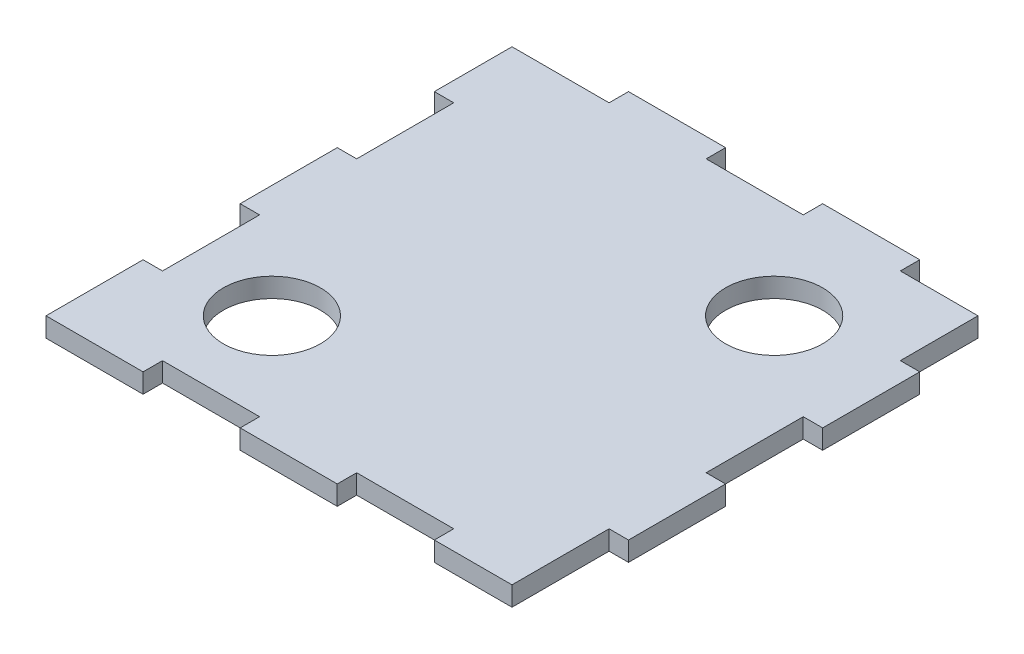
ISO-10303-21;
HEADER;
FILE_DESCRIPTION(('STEP AP214'),'2;1');
FILE_NAME('part.step','',(''),(''),'','','');
FILE_SCHEMA(('AUTOMOTIVE_DESIGN { 1 0 10303 214 1 1 1 1 }'));
ENDSEC;
DATA;
#1=APPLICATION_CONTEXT('core data for automotive mechanical design processes');
#2=APPLICATION_PROTOCOL_DEFINITION('international standard','automotive_design',2000,#1);
#3=PRODUCT_CONTEXT('',#1,'mechanical');
#4=PRODUCT('Part','Part','',(#3));
#5=PRODUCT_RELATED_PRODUCT_CATEGORY('part','',(#4));
#6=PRODUCT_DEFINITION_FORMATION('','',#4);
#7=PRODUCT_DEFINITION_CONTEXT('part definition',#1,'design');
#8=PRODUCT_DEFINITION('design','',#6,#7);
#9=PRODUCT_DEFINITION_SHAPE('','',#8);
#10=(LENGTH_UNIT() NAMED_UNIT(*) SI_UNIT(.MILLI.,.METRE.));
#11=(NAMED_UNIT(*) PLANE_ANGLE_UNIT() SI_UNIT($,.RADIAN.));
#12=(NAMED_UNIT(*) SI_UNIT($,.STERADIAN.) SOLID_ANGLE_UNIT());
#13=UNCERTAINTY_MEASURE_WITH_UNIT(LENGTH_MEASURE(1.E-05),#10,'distance_accuracy_value','');
#14=(GEOMETRIC_REPRESENTATION_CONTEXT(3) GLOBAL_UNCERTAINTY_ASSIGNED_CONTEXT((#13)) GLOBAL_UNIT_ASSIGNED_CONTEXT((#10,
#11,#12)) REPRESENTATION_CONTEXT('',''));
#15=CARTESIAN_POINT('',(0.,0.,0.));
#16=DIRECTION('',(0.,0.,1.));
#17=DIRECTION('',(1.,0.,0.));
#18=AXIS2_PLACEMENT_3D('',#15,#16,#17);
#19=CARTESIAN_POINT('',(0.,4.,0.));
#20=DIRECTION('',(0.,1.,0.));
#21=DIRECTION('',(0.,0.,1.));
#22=AXIS2_PLACEMENT_3D('',#19,#20,#21);
#23=PLANE('',#22);
#24=CARTESIAN_POINT('',(25.,4.,-25.));
#25=DIRECTION('',(0.,1.,0.));
#26=DIRECTION('',(0.,0.,1.));
#27=AXIS2_PLACEMENT_3D('',#24,#25,#26);
#28=CIRCLE('',#27,10.);
#29=CARTESIAN_POINT('',(25.,4.,-15.));
#30=VERTEX_POINT('',#29);
#31=EDGE_CURVE('E302',#30,#30,#28,.T.);
#32=ORIENTED_EDGE('',*,*,#31,.F.);
#33=EDGE_LOOP('',(#32));
#34=FACE_BOUND('',#33,.T.);
#35=DIRECTION('',(0.,0.,-1.));
#36=VECTOR('',#35,1.);
#37=CARTESIAN_POINT('',(46.,4.,30.));
#38=LINE('',#37,#36);
#39=CARTESIAN_POINT('',(46.,4.,50.));
#40=VERTEX_POINT('',#39);
#41=CARTESIAN_POINT('',(46.,4.,30.));
#42=VERTEX_POINT('',#41);
#43=EDGE_CURVE('E369',#40,#42,#38,.T.);
#44=ORIENTED_EDGE('',*,*,#43,.T.);
#45=DIRECTION('',(1.,0.,0.));
#46=VECTOR('',#45,1.);
#47=CARTESIAN_POINT('',(50.,4.,30.));
#48=LINE('',#47,#46);
#49=CARTESIAN_POINT('',(50.,4.,30.));
#50=VERTEX_POINT('',#49);
#51=EDGE_CURVE('E177',#42,#50,#48,.T.);
#52=ORIENTED_EDGE('',*,*,#51,.T.);
#53=DIRECTION('',(0.,0.,-1.));
#54=VECTOR('',#53,1.);
#55=CARTESIAN_POINT('',(50.,4.,9.99999999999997));
#56=LINE('',#55,#54);
#57=CARTESIAN_POINT('',(50.,4.,9.99999999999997));
#58=VERTEX_POINT('',#57);
#59=EDGE_CURVE('E468',#50,#58,#56,.T.);
#60=ORIENTED_EDGE('',*,*,#59,.T.);
#61=DIRECTION('',(-1.,0.,0.));
#62=VECTOR('',#61,1.);
#63=CARTESIAN_POINT('',(46.,4.,9.99999999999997));
#64=LINE('',#63,#62);
#65=CARTESIAN_POINT('',(46.,4.,9.99999999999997));
#66=VERTEX_POINT('',#65);
#67=EDGE_CURVE('E487',#58,#66,#64,.T.);
#68=ORIENTED_EDGE('',*,*,#67,.T.);
#69=DIRECTION('',(0.,0.,-1.));
#70=VECTOR('',#69,1.);
#71=CARTESIAN_POINT('',(46.,4.,-10.));
#72=LINE('',#71,#70);
#73=CARTESIAN_POINT('',(46.,4.,-10.));
#74=VERTEX_POINT('',#73);
#75=EDGE_CURVE('E484',#66,#74,#72,.T.);
#76=ORIENTED_EDGE('',*,*,#75,.T.);
#77=DIRECTION('',(1.,0.,0.));
#78=VECTOR('',#77,1.);
#79=CARTESIAN_POINT('',(50.,4.,-10.));
#80=LINE('',#79,#78);
#81=CARTESIAN_POINT('',(50.,4.,-10.));
#82=VERTEX_POINT('',#81);
#83=EDGE_CURVE('E486',#74,#82,#80,.T.);
#84=ORIENTED_EDGE('',*,*,#83,.T.);
#85=DIRECTION('',(0.,0.,-1.));
#86=VECTOR('',#85,1.);
#87=CARTESIAN_POINT('',(50.,4.,-30.));
#88=LINE('',#87,#86);
#89=CARTESIAN_POINT('',(50.,4.,-30.));
#90=VERTEX_POINT('',#89);
#91=EDGE_CURVE('E489',#82,#90,#88,.T.);
#92=ORIENTED_EDGE('',*,*,#91,.T.);
#93=DIRECTION('',(-1.,0.,0.));
#94=VECTOR('',#93,1.);
#95=CARTESIAN_POINT('',(46.,4.,-30.));
#96=LINE('',#95,#94);
#97=CARTESIAN_POINT('',(46.,4.,-30.));
#98=VERTEX_POINT('',#97);
#99=EDGE_CURVE('E495',#90,#98,#96,.T.);
#100=ORIENTED_EDGE('',*,*,#99,.T.);
#101=DIRECTION('',(0.,0.,-1.));
#102=VECTOR('',#101,1.);
#103=CARTESIAN_POINT('',(46.,4.,-46.));
#104=LINE('',#103,#102);
#105=CARTESIAN_POINT('',(46.,4.,-46.));
#106=VERTEX_POINT('',#105);
#107=EDGE_CURVE('E497',#98,#106,#104,.T.);
#108=ORIENTED_EDGE('',*,*,#107,.T.);
#109=DIRECTION('',(-1.,0.,0.));
#110=VECTOR('',#109,1.);
#111=CARTESIAN_POINT('',(30.,4.,-46.));
#112=LINE('',#111,#110);
#113=CARTESIAN_POINT('',(30.,4.,-46.));
#114=VERTEX_POINT('',#113);
#115=EDGE_CURVE('E499',#106,#114,#112,.T.);
#116=ORIENTED_EDGE('',*,*,#115,.T.);
#117=DIRECTION('',(0.,0.,-1.));
#118=VECTOR('',#117,1.);
#119=CARTESIAN_POINT('',(30.,4.,-50.));
#120=LINE('',#119,#118);
#121=CARTESIAN_POINT('',(30.,4.,-50.));
#122=VERTEX_POINT('',#121);
#123=EDGE_CURVE('E501',#114,#122,#120,.T.);
#124=ORIENTED_EDGE('',*,*,#123,.T.);
#125=DIRECTION('',(-1.,0.,0.));
#126=VECTOR('',#125,1.);
#127=CARTESIAN_POINT('',(9.99999999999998,4.,-50.));
#128=LINE('',#127,#126);
#129=CARTESIAN_POINT('',(9.99999999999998,4.,-50.));
#130=VERTEX_POINT('',#129);
#131=EDGE_CURVE('E503',#122,#130,#128,.T.);
#132=ORIENTED_EDGE('',*,*,#131,.T.);
#133=DIRECTION('',(0.,0.,1.));
#134=VECTOR('',#133,1.);
#135=CARTESIAN_POINT('',(9.99999999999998,4.,-46.));
#136=LINE('',#135,#134);
#137=CARTESIAN_POINT('',(9.99999999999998,4.,-46.));
#138=VERTEX_POINT('',#137);
#139=EDGE_CURVE('E505',#130,#138,#136,.T.);
#140=ORIENTED_EDGE('',*,*,#139,.T.);
#141=DIRECTION('',(-1.,0.,0.));
#142=VECTOR('',#141,1.);
#143=CARTESIAN_POINT('',(-10.,4.,-46.));
#144=LINE('',#143,#142);
#145=CARTESIAN_POINT('',(-10.,4.,-46.));
#146=VERTEX_POINT('',#145);
#147=EDGE_CURVE('E507',#138,#146,#144,.T.);
#148=ORIENTED_EDGE('',*,*,#147,.T.);
#149=DIRECTION('',(0.,0.,-1.));
#150=VECTOR('',#149,1.);
#151=CARTESIAN_POINT('',(-10.,4.,-50.));
#152=LINE('',#151,#150);
#153=CARTESIAN_POINT('',(-10.,4.,-50.));
#154=VERTEX_POINT('',#153);
#155=EDGE_CURVE('E509',#146,#154,#152,.T.);
#156=ORIENTED_EDGE('',*,*,#155,.T.);
#157=DIRECTION('',(-1.,0.,0.));
#158=VECTOR('',#157,1.);
#159=CARTESIAN_POINT('',(-30.,4.,-50.));
#160=LINE('',#159,#158);
#161=CARTESIAN_POINT('',(-30.,4.,-50.));
#162=VERTEX_POINT('',#161);
#163=EDGE_CURVE('E511',#154,#162,#160,.T.);
#164=ORIENTED_EDGE('',*,*,#163,.T.);
#165=DIRECTION('',(0.,0.,1.));
#166=VECTOR('',#165,1.);
#167=CARTESIAN_POINT('',(-30.,4.,-46.));
#168=LINE('',#167,#166);
#169=CARTESIAN_POINT('',(-30.,4.,-46.));
#170=VERTEX_POINT('',#169);
#171=EDGE_CURVE('E513',#162,#170,#168,.T.);
#172=ORIENTED_EDGE('',*,*,#171,.T.);
#173=DIRECTION('',(-1.,0.,0.));
#174=VECTOR('',#173,1.);
#175=CARTESIAN_POINT('',(-50.,4.,-46.));
#176=LINE('',#175,#174);
#177=CARTESIAN_POINT('',(-50.,4.,-46.));
#178=VERTEX_POINT('',#177);
#179=EDGE_CURVE('E515',#170,#178,#176,.T.);
#180=ORIENTED_EDGE('',*,*,#179,.T.);
#181=DIRECTION('',(0.,0.,1.));
#182=VECTOR('',#181,1.);
#183=CARTESIAN_POINT('',(-50.,4.,-46.));
#184=LINE('',#183,#182);
#185=CARTESIAN_POINT('',(-50.,4.,-30.));
#186=VERTEX_POINT('',#185);
#187=EDGE_CURVE('E517',#178,#186,#184,.T.);
#188=ORIENTED_EDGE('',*,*,#187,.T.);
#189=DIRECTION('',(1.,0.,0.));
#190=VECTOR('',#189,1.);
#191=CARTESIAN_POINT('',(-50.,4.,-30.));
#192=LINE('',#191,#190);
#193=CARTESIAN_POINT('',(-46.,4.,-30.));
#194=VERTEX_POINT('',#193);
#195=EDGE_CURVE('E519',#186,#194,#192,.T.);
#196=ORIENTED_EDGE('',*,*,#195,.T.);
#197=DIRECTION('',(0.,0.,1.));
#198=VECTOR('',#197,1.);
#199=CARTESIAN_POINT('',(-46.,4.,-30.));
#200=LINE('',#199,#198);
#201=CARTESIAN_POINT('',(-46.,4.,-10.));
#202=VERTEX_POINT('',#201);
#203=EDGE_CURVE('E521',#194,#202,#200,.T.);
#204=ORIENTED_EDGE('',*,*,#203,.T.);
#205=DIRECTION('',(-1.,0.,0.));
#206=VECTOR('',#205,1.);
#207=CARTESIAN_POINT('',(-46.,4.,-10.));
#208=LINE('',#207,#206);
#209=CARTESIAN_POINT('',(-50.,4.,-10.));
#210=VERTEX_POINT('',#209);
#211=EDGE_CURVE('E523',#202,#210,#208,.T.);
#212=ORIENTED_EDGE('',*,*,#211,.T.);
#213=DIRECTION('',(0.,0.,1.));
#214=VECTOR('',#213,1.);
#215=CARTESIAN_POINT('',(-50.,4.,-10.));
#216=LINE('',#215,#214);
#217=CARTESIAN_POINT('',(-50.,4.,9.99999999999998));
#218=VERTEX_POINT('',#217);
#219=EDGE_CURVE('E525',#210,#218,#216,.T.);
#220=ORIENTED_EDGE('',*,*,#219,.T.);
#221=DIRECTION('',(1.,0.,0.));
#222=VECTOR('',#221,1.);
#223=CARTESIAN_POINT('',(-50.,4.,9.99999999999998));
#224=LINE('',#223,#222);
#225=CARTESIAN_POINT('',(-46.,4.,9.99999999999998));
#226=VERTEX_POINT('',#225);
#227=EDGE_CURVE('E527',#218,#226,#224,.T.);
#228=ORIENTED_EDGE('',*,*,#227,.T.);
#229=DIRECTION('',(0.,0.,1.));
#230=VECTOR('',#229,1.);
#231=CARTESIAN_POINT('',(-46.,4.,9.99999999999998));
#232=LINE('',#231,#230);
#233=CARTESIAN_POINT('',(-46.,4.,30.));
#234=VERTEX_POINT('',#233);
#235=EDGE_CURVE('E529',#226,#234,#232,.T.);
#236=ORIENTED_EDGE('',*,*,#235,.T.);
#237=DIRECTION('',(-1.,0.,0.));
#238=VECTOR('',#237,1.);
#239=CARTESIAN_POINT('',(-46.,4.,30.));
#240=LINE('',#239,#238);
#241=CARTESIAN_POINT('',(-50.,4.,30.));
#242=VERTEX_POINT('',#241);
#243=EDGE_CURVE('E531',#234,#242,#240,.T.);
#244=ORIENTED_EDGE('',*,*,#243,.T.);
#245=DIRECTION('',(0.,0.,1.));
#246=VECTOR('',#245,1.);
#247=CARTESIAN_POINT('',(-50.,4.,30.));
#248=LINE('',#247,#246);
#249=CARTESIAN_POINT('',(-50.,4.,50.));
#250=VERTEX_POINT('',#249);
#251=EDGE_CURVE('E533',#242,#250,#248,.T.);
#252=ORIENTED_EDGE('',*,*,#251,.T.);
#253=DIRECTION('',(1.,0.,0.));
#254=VECTOR('',#253,1.);
#255=CARTESIAN_POINT('',(-50.,4.,50.));
#256=LINE('',#255,#254);
#257=CARTESIAN_POINT('',(-30.,4.,50.));
#258=VERTEX_POINT('',#257);
#259=EDGE_CURVE('E535',#250,#258,#256,.T.);
#260=ORIENTED_EDGE('',*,*,#259,.T.);
#261=DIRECTION('',(0.,0.,-1.));
#262=VECTOR('',#261,1.);
#263=CARTESIAN_POINT('',(-30.,4.,46.));
#264=LINE('',#263,#262);
#265=CARTESIAN_POINT('',(-30.,4.,46.));
#266=VERTEX_POINT('',#265);
#267=EDGE_CURVE('E537',#258,#266,#264,.T.);
#268=ORIENTED_EDGE('',*,*,#267,.T.);
#269=DIRECTION('',(1.,0.,0.));
#270=VECTOR('',#269,1.);
#271=CARTESIAN_POINT('',(-10.,4.,46.));
#272=LINE('',#271,#270);
#273=CARTESIAN_POINT('',(-10.,4.,46.));
#274=VERTEX_POINT('',#273);
#275=EDGE_CURVE('E539',#266,#274,#272,.T.);
#276=ORIENTED_EDGE('',*,*,#275,.T.);
#277=DIRECTION('',(0.,0.,1.));
#278=VECTOR('',#277,1.);
#279=CARTESIAN_POINT('',(-10.,4.,50.));
#280=LINE('',#279,#278);
#281=CARTESIAN_POINT('',(-10.,4.,50.));
#282=VERTEX_POINT('',#281);
#283=EDGE_CURVE('E541',#274,#282,#280,.T.);
#284=ORIENTED_EDGE('',*,*,#283,.T.);
#285=DIRECTION('',(1.,0.,0.));
#286=VECTOR('',#285,1.);
#287=CARTESIAN_POINT('',(-10.,4.,50.));
#288=LINE('',#287,#286);
#289=CARTESIAN_POINT('',(9.99999999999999,4.,50.));
#290=VERTEX_POINT('',#289);
#291=EDGE_CURVE('E543',#282,#290,#288,.T.);
#292=ORIENTED_EDGE('',*,*,#291,.T.);
#293=DIRECTION('',(0.,0.,-1.));
#294=VECTOR('',#293,1.);
#295=CARTESIAN_POINT('',(9.99999999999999,4.,50.));
#296=LINE('',#295,#294);
#297=CARTESIAN_POINT('',(9.99999999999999,4.,46.));
#298=VERTEX_POINT('',#297);
#299=EDGE_CURVE('E280',#290,#298,#296,.T.);
#300=ORIENTED_EDGE('',*,*,#299,.T.);
#301=DIRECTION('',(1.,0.,0.));
#302=VECTOR('',#301,1.);
#303=CARTESIAN_POINT('',(9.99999999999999,4.,46.));
#304=LINE('',#303,#302);
#305=CARTESIAN_POINT('',(30.,4.,46.));
#306=VERTEX_POINT('',#305);
#307=EDGE_CURVE('E274',#298,#306,#304,.T.);
#308=ORIENTED_EDGE('',*,*,#307,.T.);
#309=DIRECTION('',(0.,0.,1.));
#310=VECTOR('',#309,1.);
#311=CARTESIAN_POINT('',(30.,4.,46.));
#312=LINE('',#311,#310);
#313=CARTESIAN_POINT('',(30.,4.,50.));
#314=VERTEX_POINT('',#313);
#315=EDGE_CURVE('E278',#306,#314,#312,.T.);
#316=ORIENTED_EDGE('',*,*,#315,.T.);
#317=DIRECTION('',(1.,0.,0.));
#318=VECTOR('',#317,1.);
#319=CARTESIAN_POINT('',(30.,4.,50.));
#320=LINE('',#319,#318);
#321=EDGE_CURVE('E50',#314,#40,#320,.T.);
#322=ORIENTED_EDGE('',*,*,#321,.T.);
#323=EDGE_LOOP('',(#44,#52,#60,#68,#76,#84,#92,#100,#108,#116,#124,#132,#140,#148,#156,#164,
#172,#180,#188,#196,#204,#212,#220,#228,#236,#244,#252,#260,#268,#276,#284,#292,#300,#308,#316,#322));
#324=FACE_BOUND('',#323,.T.);
#325=CARTESIAN_POINT('',(-26.7320869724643,4.,26.7320869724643));
#326=DIRECTION('',(0.,1.,0.));
#327=DIRECTION('',(0.,0.,1.));
#328=AXIS2_PLACEMENT_3D('',#325,#326,#327);
#329=CIRCLE('',#328,10.);
#330=CARTESIAN_POINT('',(-26.7320869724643,4.,36.7320869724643));
#331=VERTEX_POINT('',#330);
#332=EDGE_CURVE('E585',#331,#331,#329,.T.);
#333=ORIENTED_EDGE('',*,*,#332,.F.);
#334=EDGE_LOOP('',(#333));
#335=FACE_BOUND('',#334,.T.);
#336=ADVANCED_FACE('F33',(#34,#324,#335),#23,.T.);
#337=CARTESIAN_POINT('',(0.,0.,0.));
#338=DIRECTION('',(0.,1.,0.));
#339=DIRECTION('',(0.,0.,1.));
#340=AXIS2_PLACEMENT_3D('',#337,#338,#339);
#341=PLANE('',#340);
#342=DIRECTION('',(0.,0.,-1.));
#343=VECTOR('',#342,1.);
#344=CARTESIAN_POINT('',(46.,0.,30.));
#345=LINE('',#344,#343);
#346=CARTESIAN_POINT('',(46.,0.,50.));
#347=VERTEX_POINT('',#346);
#348=CARTESIAN_POINT('',(46.,0.,30.));
#349=VERTEX_POINT('',#348);
#350=EDGE_CURVE('E298',#347,#349,#345,.T.);
#351=ORIENTED_EDGE('',*,*,#350,.F.);
#352=DIRECTION('',(1.,0.,0.));
#353=VECTOR('',#352,1.);
#354=CARTESIAN_POINT('',(30.,0.,50.));
#355=LINE('',#354,#353);
#356=CARTESIAN_POINT('',(30.,0.,50.));
#357=VERTEX_POINT('',#356);
#358=EDGE_CURVE('E169',#357,#347,#355,.T.);
#359=ORIENTED_EDGE('',*,*,#358,.F.);
#360=DIRECTION('',(0.,0.,1.));
#361=VECTOR('',#360,1.);
#362=CARTESIAN_POINT('',(30.,0.,46.));
#363=LINE('',#362,#361);
#364=CARTESIAN_POINT('',(30.,0.,46.));
#365=VERTEX_POINT('',#364);
#366=EDGE_CURVE('E163',#365,#357,#363,.T.);
#367=ORIENTED_EDGE('',*,*,#366,.F.);
#368=DIRECTION('',(1.,0.,0.));
#369=VECTOR('',#368,1.);
#370=CARTESIAN_POINT('',(9.99999999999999,0.,46.));
#371=LINE('',#370,#369);
#372=CARTESIAN_POINT('',(9.99999999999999,0.,46.));
#373=VERTEX_POINT('',#372);
#374=EDGE_CURVE('E288',#373,#365,#371,.T.);
#375=ORIENTED_EDGE('',*,*,#374,.F.);
#376=DIRECTION('',(0.,0.,-1.));
#377=VECTOR('',#376,1.);
#378=CARTESIAN_POINT('',(9.99999999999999,0.,50.));
#379=LINE('',#378,#377);
#380=CARTESIAN_POINT('',(9.99999999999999,0.,50.));
#381=VERTEX_POINT('',#380);
#382=EDGE_CURVE('E364',#381,#373,#379,.T.);
#383=ORIENTED_EDGE('',*,*,#382,.F.);
#384=DIRECTION('',(1.,0.,0.));
#385=VECTOR('',#384,1.);
#386=CARTESIAN_POINT('',(-10.,0.,50.));
#387=LINE('',#386,#385);
#388=CARTESIAN_POINT('',(-10.,0.,50.));
#389=VERTEX_POINT('',#388);
#390=EDGE_CURVE('E362',#389,#381,#387,.T.);
#391=ORIENTED_EDGE('',*,*,#390,.F.);
#392=DIRECTION('',(0.,0.,1.));
#393=VECTOR('',#392,1.);
#394=CARTESIAN_POINT('',(-10.,0.,50.));
#395=LINE('',#394,#393);
#396=CARTESIAN_POINT('',(-10.,0.,46.));
#397=VERTEX_POINT('',#396);
#398=EDGE_CURVE('E360',#397,#389,#395,.T.);
#399=ORIENTED_EDGE('',*,*,#398,.F.);
#400=DIRECTION('',(1.,0.,0.));
#401=VECTOR('',#400,1.);
#402=CARTESIAN_POINT('',(-10.,0.,46.));
#403=LINE('',#402,#401);
#404=CARTESIAN_POINT('',(-30.,0.,46.));
#405=VERTEX_POINT('',#404);
#406=EDGE_CURVE('E358',#405,#397,#403,.T.);
#407=ORIENTED_EDGE('',*,*,#406,.F.);
#408=DIRECTION('',(0.,0.,-1.));
#409=VECTOR('',#408,1.);
#410=CARTESIAN_POINT('',(-30.,0.,46.));
#411=LINE('',#410,#409);
#412=CARTESIAN_POINT('',(-30.,0.,50.));
#413=VERTEX_POINT('',#412);
#414=EDGE_CURVE('E356',#413,#405,#411,.T.);
#415=ORIENTED_EDGE('',*,*,#414,.F.);
#416=DIRECTION('',(1.,0.,0.));
#417=VECTOR('',#416,1.);
#418=CARTESIAN_POINT('',(-50.,0.,50.));
#419=LINE('',#418,#417);
#420=CARTESIAN_POINT('',(-50.,0.,50.));
#421=VERTEX_POINT('',#420);
#422=EDGE_CURVE('E354',#421,#413,#419,.T.);
#423=ORIENTED_EDGE('',*,*,#422,.F.);
#424=DIRECTION('',(0.,0.,1.));
#425=VECTOR('',#424,1.);
#426=CARTESIAN_POINT('',(-50.,0.,30.));
#427=LINE('',#426,#425);
#428=CARTESIAN_POINT('',(-50.,0.,30.));
#429=VERTEX_POINT('',#428);
#430=EDGE_CURVE('E352',#429,#421,#427,.T.);
#431=ORIENTED_EDGE('',*,*,#430,.F.);
#432=DIRECTION('',(-1.,0.,0.));
#433=VECTOR('',#432,1.);
#434=CARTESIAN_POINT('',(-46.,0.,30.));
#435=LINE('',#434,#433);
#436=CARTESIAN_POINT('',(-46.,0.,30.));
#437=VERTEX_POINT('',#436);
#438=EDGE_CURVE('E350',#437,#429,#435,.T.);
#439=ORIENTED_EDGE('',*,*,#438,.F.);
#440=DIRECTION('',(0.,0.,1.));
#441=VECTOR('',#440,1.);
#442=CARTESIAN_POINT('',(-46.,0.,9.99999999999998));
#443=LINE('',#442,#441);
#444=CARTESIAN_POINT('',(-46.,0.,9.99999999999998));
#445=VERTEX_POINT('',#444);
#446=EDGE_CURVE('E348',#445,#437,#443,.T.);
#447=ORIENTED_EDGE('',*,*,#446,.F.);
#448=DIRECTION('',(1.,0.,0.));
#449=VECTOR('',#448,1.);
#450=CARTESIAN_POINT('',(-50.,0.,9.99999999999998));
#451=LINE('',#450,#449);
#452=CARTESIAN_POINT('',(-50.,0.,9.99999999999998));
#453=VERTEX_POINT('',#452);
#454=EDGE_CURVE('E346',#453,#445,#451,.T.);
#455=ORIENTED_EDGE('',*,*,#454,.F.);
#456=DIRECTION('',(0.,0.,1.));
#457=VECTOR('',#456,1.);
#458=CARTESIAN_POINT('',(-50.,0.,-10.));
#459=LINE('',#458,#457);
#460=CARTESIAN_POINT('',(-50.,0.,-10.));
#461=VERTEX_POINT('',#460);
#462=EDGE_CURVE('E344',#461,#453,#459,.T.);
#463=ORIENTED_EDGE('',*,*,#462,.F.);
#464=DIRECTION('',(-1.,0.,0.));
#465=VECTOR('',#464,1.);
#466=CARTESIAN_POINT('',(-46.,0.,-10.));
#467=LINE('',#466,#465);
#468=CARTESIAN_POINT('',(-46.,0.,-10.));
#469=VERTEX_POINT('',#468);
#470=EDGE_CURVE('E342',#469,#461,#467,.T.);
#471=ORIENTED_EDGE('',*,*,#470,.F.);
#472=DIRECTION('',(0.,0.,1.));
#473=VECTOR('',#472,1.);
#474=CARTESIAN_POINT('',(-46.,0.,-30.));
#475=LINE('',#474,#473);
#476=CARTESIAN_POINT('',(-46.,0.,-30.));
#477=VERTEX_POINT('',#476);
#478=EDGE_CURVE('E340',#477,#469,#475,.T.);
#479=ORIENTED_EDGE('',*,*,#478,.F.);
#480=DIRECTION('',(1.,0.,0.));
#481=VECTOR('',#480,1.);
#482=CARTESIAN_POINT('',(-50.,0.,-30.));
#483=LINE('',#482,#481);
#484=CARTESIAN_POINT('',(-50.,0.,-30.));
#485=VERTEX_POINT('',#484);
#486=EDGE_CURVE('E338',#485,#477,#483,.T.);
#487=ORIENTED_EDGE('',*,*,#486,.F.);
#488=DIRECTION('',(0.,0.,1.));
#489=VECTOR('',#488,1.);
#490=CARTESIAN_POINT('',(-50.,0.,-46.));
#491=LINE('',#490,#489);
#492=CARTESIAN_POINT('',(-50.,0.,-46.));
#493=VERTEX_POINT('',#492);
#494=EDGE_CURVE('E336',#493,#485,#491,.T.);
#495=ORIENTED_EDGE('',*,*,#494,.F.);
#496=DIRECTION('',(-1.,0.,0.));
#497=VECTOR('',#496,1.);
#498=CARTESIAN_POINT('',(-50.,0.,-46.));
#499=LINE('',#498,#497);
#500=CARTESIAN_POINT('',(-30.,0.,-46.));
#501=VERTEX_POINT('',#500);
#502=EDGE_CURVE('E334',#501,#493,#499,.T.);
#503=ORIENTED_EDGE('',*,*,#502,.F.);
#504=DIRECTION('',(0.,0.,1.));
#505=VECTOR('',#504,1.);
#506=CARTESIAN_POINT('',(-30.,0.,-46.));
#507=LINE('',#506,#505);
#508=CARTESIAN_POINT('',(-30.,0.,-50.));
#509=VERTEX_POINT('',#508);
#510=EDGE_CURVE('E332',#509,#501,#507,.T.);
#511=ORIENTED_EDGE('',*,*,#510,.F.);
#512=DIRECTION('',(-1.,0.,0.));
#513=VECTOR('',#512,1.);
#514=CARTESIAN_POINT('',(-30.,0.,-50.));
#515=LINE('',#514,#513);
#516=CARTESIAN_POINT('',(-10.,0.,-50.));
#517=VERTEX_POINT('',#516);
#518=EDGE_CURVE('E330',#517,#509,#515,.T.);
#519=ORIENTED_EDGE('',*,*,#518,.F.);
#520=DIRECTION('',(0.,0.,-1.));
#521=VECTOR('',#520,1.);
#522=CARTESIAN_POINT('',(-10.,0.,-50.));
#523=LINE('',#522,#521);
#524=CARTESIAN_POINT('',(-10.,0.,-46.));
#525=VERTEX_POINT('',#524);
#526=EDGE_CURVE('E328',#525,#517,#523,.T.);
#527=ORIENTED_EDGE('',*,*,#526,.F.);
#528=DIRECTION('',(-1.,0.,0.));
#529=VECTOR('',#528,1.);
#530=CARTESIAN_POINT('',(-10.,0.,-46.));
#531=LINE('',#530,#529);
#532=CARTESIAN_POINT('',(9.99999999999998,0.,-46.));
#533=VERTEX_POINT('',#532);
#534=EDGE_CURVE('E326',#533,#525,#531,.T.);
#535=ORIENTED_EDGE('',*,*,#534,.F.);
#536=DIRECTION('',(0.,0.,1.));
#537=VECTOR('',#536,1.);
#538=CARTESIAN_POINT('',(9.99999999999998,0.,-46.));
#539=LINE('',#538,#537);
#540=CARTESIAN_POINT('',(9.99999999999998,0.,-50.));
#541=VERTEX_POINT('',#540);
#542=EDGE_CURVE('E324',#541,#533,#539,.T.);
#543=ORIENTED_EDGE('',*,*,#542,.F.);
#544=DIRECTION('',(-1.,0.,0.));
#545=VECTOR('',#544,1.);
#546=CARTESIAN_POINT('',(9.99999999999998,0.,-50.));
#547=LINE('',#546,#545);
#548=CARTESIAN_POINT('',(30.,0.,-50.));
#549=VERTEX_POINT('',#548);
#550=EDGE_CURVE('E322',#549,#541,#547,.T.);
#551=ORIENTED_EDGE('',*,*,#550,.F.);
#552=DIRECTION('',(0.,0.,-1.));
#553=VECTOR('',#552,1.);
#554=CARTESIAN_POINT('',(30.,0.,-50.));
#555=LINE('',#554,#553);
#556=CARTESIAN_POINT('',(30.,0.,-46.));
#557=VERTEX_POINT('',#556);
#558=EDGE_CURVE('E320',#557,#549,#555,.T.);
#559=ORIENTED_EDGE('',*,*,#558,.F.);
#560=DIRECTION('',(-1.,0.,0.));
#561=VECTOR('',#560,1.);
#562=CARTESIAN_POINT('',(30.,0.,-46.));
#563=LINE('',#562,#561);
#564=CARTESIAN_POINT('',(46.,0.,-46.));
#565=VERTEX_POINT('',#564);
#566=EDGE_CURVE('E318',#565,#557,#563,.T.);
#567=ORIENTED_EDGE('',*,*,#566,.F.);
#568=DIRECTION('',(0.,0.,-1.));
#569=VECTOR('',#568,1.);
#570=CARTESIAN_POINT('',(46.,0.,-46.));
#571=LINE('',#570,#569);
#572=CARTESIAN_POINT('',(46.,0.,-30.));
#573=VERTEX_POINT('',#572);
#574=EDGE_CURVE('E316',#573,#565,#571,.T.);
#575=ORIENTED_EDGE('',*,*,#574,.F.);
#576=DIRECTION('',(-1.,0.,0.));
#577=VECTOR('',#576,1.);
#578=CARTESIAN_POINT('',(46.,0.,-30.));
#579=LINE('',#578,#577);
#580=CARTESIAN_POINT('',(50.,0.,-30.));
#581=VERTEX_POINT('',#580);
#582=EDGE_CURVE('E314',#581,#573,#579,.T.);
#583=ORIENTED_EDGE('',*,*,#582,.F.);
#584=DIRECTION('',(0.,0.,-1.));
#585=VECTOR('',#584,1.);
#586=CARTESIAN_POINT('',(50.,0.,-30.));
#587=LINE('',#586,#585);
#588=CARTESIAN_POINT('',(50.,0.,-10.));
#589=VERTEX_POINT('',#588);
#590=EDGE_CURVE('E312',#589,#581,#587,.T.);
#591=ORIENTED_EDGE('',*,*,#590,.F.);
#592=DIRECTION('',(1.,0.,0.));
#593=VECTOR('',#592,1.);
#594=CARTESIAN_POINT('',(50.,0.,-10.));
#595=LINE('',#594,#593);
#596=CARTESIAN_POINT('',(46.,0.,-10.));
#597=VERTEX_POINT('',#596);
#598=EDGE_CURVE('E310',#597,#589,#595,.T.);
#599=ORIENTED_EDGE('',*,*,#598,.F.);
#600=DIRECTION('',(0.,0.,-1.));
#601=VECTOR('',#600,1.);
#602=CARTESIAN_POINT('',(46.,0.,-10.));
#603=LINE('',#602,#601);
#604=CARTESIAN_POINT('',(46.,0.,9.99999999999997));
#605=VERTEX_POINT('',#604);
#606=EDGE_CURVE('E308',#605,#597,#603,.T.);
#607=ORIENTED_EDGE('',*,*,#606,.F.);
#608=DIRECTION('',(-1.,0.,0.));
#609=VECTOR('',#608,1.);
#610=CARTESIAN_POINT('',(46.,0.,9.99999999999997));
#611=LINE('',#610,#609);
#612=CARTESIAN_POINT('',(50.,0.,9.99999999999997));
#613=VERTEX_POINT('',#612);
#614=EDGE_CURVE('E306',#613,#605,#611,.T.);
#615=ORIENTED_EDGE('',*,*,#614,.F.);
#616=DIRECTION('',(0.,0.,-1.));
#617=VECTOR('',#616,1.);
#618=CARTESIAN_POINT('',(50.,0.,9.99999999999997));
#619=LINE('',#618,#617);
#620=CARTESIAN_POINT('',(50.,0.,30.));
#621=VERTEX_POINT('',#620);
#622=EDGE_CURVE('E304',#621,#613,#619,.T.);
#623=ORIENTED_EDGE('',*,*,#622,.F.);
#624=DIRECTION('',(1.,0.,0.));
#625=VECTOR('',#624,1.);
#626=CARTESIAN_POINT('',(50.,0.,30.));
#627=LINE('',#626,#625);
#628=EDGE_CURVE('E301',#349,#621,#627,.T.);
#629=ORIENTED_EDGE('',*,*,#628,.F.);
#630=EDGE_LOOP('',(#351,#359,#367,#375,#383,#391,#399,#407,#415,#423,#431,#439,#447,#455,#463,
#471,#479,#487,#495,#503,#511,#519,#527,#535,#543,#551,#559,#567,#575,#583,#591,#599,#607,#615,
#623,#629));
#631=FACE_BOUND('',#630,.T.);
#632=CARTESIAN_POINT('',(25.,0.,-25.));
#633=DIRECTION('',(0.,1.,0.));
#634=DIRECTION('',(0.,0.,1.));
#635=AXIS2_PLACEMENT_3D('',#632,#633,#634);
#636=CIRCLE('',#635,10.);
#637=CARTESIAN_POINT('',(25.,0.,-15.));
#638=VERTEX_POINT('',#637);
#639=EDGE_CURVE('E591',#638,#638,#636,.T.);
#640=ORIENTED_EDGE('',*,*,#639,.T.);
#641=EDGE_LOOP('',(#640));
#642=FACE_BOUND('',#641,.T.);
#643=CARTESIAN_POINT('',(-26.7320869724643,0.,26.7320869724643));
#644=DIRECTION('',(0.,1.,0.));
#645=DIRECTION('',(0.,0.,1.));
#646=AXIS2_PLACEMENT_3D('',#643,#644,#645);
#647=CIRCLE('',#646,10.);
#648=CARTESIAN_POINT('',(-26.7320869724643,0.,36.7320869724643));
#649=VERTEX_POINT('',#648);
#650=EDGE_CURVE('E588',#649,#649,#647,.T.);
#651=ORIENTED_EDGE('',*,*,#650,.T.);
#652=EDGE_LOOP('',(#651));
#653=FACE_BOUND('',#652,.T.);
#654=ADVANCED_FACE('F472',(#631,#642,#653),#341,.F.);
#655=CARTESIAN_POINT('',(46.,4.,30.));
#656=DIRECTION('',(-1.,0.,0.));
#657=DIRECTION('',(0.,0.,1.));
#658=AXIS2_PLACEMENT_3D('',#655,#656,#657);
#659=PLANE('',#658);
#660=ORIENTED_EDGE('',*,*,#350,.T.);
#661=DIRECTION('',(0.,-1.,0.));
#662=VECTOR('',#661,1.);
#663=CARTESIAN_POINT('',(46.,4.,30.));
#664=LINE('',#663,#662);
#665=EDGE_CURVE('E11',#42,#349,#664,.T.);
#666=ORIENTED_EDGE('',*,*,#665,.F.);
#667=ORIENTED_EDGE('',*,*,#43,.F.);
#668=DIRECTION('',(0.,-1.,0.));
#669=VECTOR('',#668,1.);
#670=CARTESIAN_POINT('',(46.,4.,50.));
#671=LINE('',#670,#669);
#672=EDGE_CURVE('E294',#40,#347,#671,.T.);
#673=ORIENTED_EDGE('',*,*,#672,.T.);
#674=EDGE_LOOP('',(#660,#666,#667,#673));
#675=FACE_BOUND('',#674,.T.);
#676=ADVANCED_FACE('F35',(#675),#659,.F.);
#677=CARTESIAN_POINT('',(50.,4.,30.));
#678=DIRECTION('',(0.,0.,-1.));
#679=DIRECTION('',(-1.,0.,0.));
#680=AXIS2_PLACEMENT_3D('',#677,#678,#679);
#681=PLANE('',#680);
#682=ORIENTED_EDGE('',*,*,#628,.T.);
#683=DIRECTION('',(0.,-1.,0.));
#684=VECTOR('',#683,1.);
#685=CARTESIAN_POINT('',(50.,4.,30.));
#686=LINE('',#685,#684);
#687=EDGE_CURVE('E42',#50,#621,#686,.T.);
#688=ORIENTED_EDGE('',*,*,#687,.F.);
#689=ORIENTED_EDGE('',*,*,#51,.F.);
#690=ORIENTED_EDGE('',*,*,#665,.T.);
#691=EDGE_LOOP('',(#682,#688,#689,#690));
#692=FACE_BOUND('',#691,.T.);
#693=ADVANCED_FACE('F924',(#692),#681,.F.);
#694=CARTESIAN_POINT('',(50.,4.,9.99999999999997));
#695=DIRECTION('',(-1.,0.,0.));
#696=DIRECTION('',(0.,0.,1.));
#697=AXIS2_PLACEMENT_3D('',#694,#695,#696);
#698=PLANE('',#697);
#699=ORIENTED_EDGE('',*,*,#622,.T.);
#700=DIRECTION('',(0.,-1.,0.));
#701=VECTOR('',#700,1.);
#702=CARTESIAN_POINT('',(50.,4.,9.99999999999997));
#703=LINE('',#702,#701);
#704=EDGE_CURVE('E460',#58,#613,#703,.T.);
#705=ORIENTED_EDGE('',*,*,#704,.F.);
#706=ORIENTED_EDGE('',*,*,#59,.F.);
#707=ORIENTED_EDGE('',*,*,#687,.T.);
#708=EDGE_LOOP('',(#699,#705,#706,#707));
#709=FACE_BOUND('',#708,.T.);
#710=ADVANCED_FACE('F466',(#709),#698,.F.);
#711=CARTESIAN_POINT('',(46.,4.,9.99999999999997));
#712=DIRECTION('',(0.,0.,1.));
#713=DIRECTION('',(1.,0.,0.));
#714=AXIS2_PLACEMENT_3D('',#711,#712,#713);
#715=PLANE('',#714);
#716=ORIENTED_EDGE('',*,*,#614,.T.);
#717=DIRECTION('',(0.,-1.,0.));
#718=VECTOR('',#717,1.);
#719=CARTESIAN_POINT('',(46.,4.,9.99999999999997));
#720=LINE('',#719,#718);
#721=EDGE_CURVE('E457',#66,#605,#720,.T.);
#722=ORIENTED_EDGE('',*,*,#721,.F.);
#723=ORIENTED_EDGE('',*,*,#67,.F.);
#724=ORIENTED_EDGE('',*,*,#704,.T.);
#725=EDGE_LOOP('',(#716,#722,#723,#724));
#726=FACE_BOUND('',#725,.T.);
#727=ADVANCED_FACE('F478',(#726),#715,.F.);
#728=CARTESIAN_POINT('',(46.,4.,-10.));
#729=DIRECTION('',(-1.,0.,0.));
#730=DIRECTION('',(0.,0.,1.));
#731=AXIS2_PLACEMENT_3D('',#728,#729,#730);
#732=PLANE('',#731);
#733=ORIENTED_EDGE('',*,*,#606,.T.);
#734=DIRECTION('',(0.,-1.,0.));
#735=VECTOR('',#734,1.);
#736=CARTESIAN_POINT('',(46.,4.,-10.));
#737=LINE('',#736,#735);
#738=EDGE_CURVE('E454',#74,#597,#737,.T.);
#739=ORIENTED_EDGE('',*,*,#738,.F.);
#740=ORIENTED_EDGE('',*,*,#75,.F.);
#741=ORIENTED_EDGE('',*,*,#721,.T.);
#742=EDGE_LOOP('',(#733,#739,#740,#741));
#743=FACE_BOUND('',#742,.T.);
#744=ADVANCED_FACE('F482',(#743),#732,.F.);
#745=CARTESIAN_POINT('',(50.,4.,-10.));
#746=DIRECTION('',(0.,0.,-1.));
#747=DIRECTION('',(-1.,0.,0.));
#748=AXIS2_PLACEMENT_3D('',#745,#746,#747);
#749=PLANE('',#748);
#750=ORIENTED_EDGE('',*,*,#598,.T.);
#751=DIRECTION('',(0.,-1.,0.));
#752=VECTOR('',#751,1.);
#753=CARTESIAN_POINT('',(50.,4.,-10.));
#754=LINE('',#753,#752);
#755=EDGE_CURVE('E451',#82,#589,#754,.T.);
#756=ORIENTED_EDGE('',*,*,#755,.F.);
#757=ORIENTED_EDGE('',*,*,#83,.F.);
#758=ORIENTED_EDGE('',*,*,#738,.T.);
#759=EDGE_LOOP('',(#750,#756,#757,#758));
#760=FACE_BOUND('',#759,.T.);
#761=ADVANCED_FACE('F889',(#760),#749,.F.);
#762=CARTESIAN_POINT('',(50.,4.,-30.));
#763=DIRECTION('',(-1.,0.,0.));
#764=DIRECTION('',(0.,0.,1.));
#765=AXIS2_PLACEMENT_3D('',#762,#763,#764);
#766=PLANE('',#765);
#767=ORIENTED_EDGE('',*,*,#590,.T.);
#768=DIRECTION('',(0.,-1.,0.));
#769=VECTOR('',#768,1.);
#770=CARTESIAN_POINT('',(50.,4.,-30.));
#771=LINE('',#770,#769);
#772=EDGE_CURVE('E448',#90,#581,#771,.T.);
#773=ORIENTED_EDGE('',*,*,#772,.F.);
#774=ORIENTED_EDGE('',*,*,#91,.F.);
#775=ORIENTED_EDGE('',*,*,#755,.T.);
#776=EDGE_LOOP('',(#767,#773,#774,#775));
#777=FACE_BOUND('',#776,.T.);
#778=ADVANCED_FACE('F879',(#777),#766,.F.);
#779=CARTESIAN_POINT('',(46.,4.,-30.));
#780=DIRECTION('',(0.,0.,1.));
#781=DIRECTION('',(1.,0.,0.));
#782=AXIS2_PLACEMENT_3D('',#779,#780,#781);
#783=PLANE('',#782);
#784=ORIENTED_EDGE('',*,*,#582,.T.);
#785=DIRECTION('',(0.,-1.,0.));
#786=VECTOR('',#785,1.);
#787=CARTESIAN_POINT('',(46.,4.,-30.));
#788=LINE('',#787,#786);
#789=EDGE_CURVE('E445',#98,#573,#788,.T.);
#790=ORIENTED_EDGE('',*,*,#789,.F.);
#791=ORIENTED_EDGE('',*,*,#99,.F.);
#792=ORIENTED_EDGE('',*,*,#772,.T.);
#793=EDGE_LOOP('',(#784,#790,#791,#792));
#794=FACE_BOUND('',#793,.T.);
#795=ADVANCED_FACE('F869',(#794),#783,.F.);
#796=CARTESIAN_POINT('',(46.,4.,-46.));
#797=DIRECTION('',(-1.,0.,0.));
#798=DIRECTION('',(0.,0.,1.));
#799=AXIS2_PLACEMENT_3D('',#796,#797,#798);
#800=PLANE('',#799);
#801=ORIENTED_EDGE('',*,*,#574,.T.);
#802=DIRECTION('',(0.,-1.,0.));
#803=VECTOR('',#802,1.);
#804=CARTESIAN_POINT('',(46.,4.,-46.));
#805=LINE('',#804,#803);
#806=EDGE_CURVE('E442',#106,#565,#805,.T.);
#807=ORIENTED_EDGE('',*,*,#806,.F.);
#808=ORIENTED_EDGE('',*,*,#107,.F.);
#809=ORIENTED_EDGE('',*,*,#789,.T.);
#810=EDGE_LOOP('',(#801,#807,#808,#809));
#811=FACE_BOUND('',#810,.T.);
#812=ADVANCED_FACE('F859',(#811),#800,.F.);
#813=CARTESIAN_POINT('',(30.,4.,-46.));
#814=DIRECTION('',(0.,0.,1.));
#815=DIRECTION('',(1.,0.,0.));
#816=AXIS2_PLACEMENT_3D('',#813,#814,#815);
#817=PLANE('',#816);
#818=ORIENTED_EDGE('',*,*,#566,.T.);
#819=DIRECTION('',(0.,-1.,0.));
#820=VECTOR('',#819,1.);
#821=CARTESIAN_POINT('',(30.,4.,-46.));
#822=LINE('',#821,#820);
#823=EDGE_CURVE('E439',#114,#557,#822,.T.);
#824=ORIENTED_EDGE('',*,*,#823,.F.);
#825=ORIENTED_EDGE('',*,*,#115,.F.);
#826=ORIENTED_EDGE('',*,*,#806,.T.);
#827=EDGE_LOOP('',(#818,#824,#825,#826));
#828=FACE_BOUND('',#827,.T.);
#829=ADVANCED_FACE('F849',(#828),#817,.F.);
#830=CARTESIAN_POINT('',(30.,4.,-50.));
#831=DIRECTION('',(-1.,0.,0.));
#832=DIRECTION('',(0.,0.,1.));
#833=AXIS2_PLACEMENT_3D('',#830,#831,#832);
#834=PLANE('',#833);
#835=ORIENTED_EDGE('',*,*,#558,.T.);
#836=DIRECTION('',(0.,-1.,0.));
#837=VECTOR('',#836,1.);
#838=CARTESIAN_POINT('',(30.,4.,-50.));
#839=LINE('',#838,#837);
#840=EDGE_CURVE('E436',#122,#549,#839,.T.);
#841=ORIENTED_EDGE('',*,*,#840,.F.);
#842=ORIENTED_EDGE('',*,*,#123,.F.);
#843=ORIENTED_EDGE('',*,*,#823,.T.);
#844=EDGE_LOOP('',(#835,#841,#842,#843));
#845=FACE_BOUND('',#844,.T.);
#846=ADVANCED_FACE('F839',(#845),#834,.F.);
#847=CARTESIAN_POINT('',(9.99999999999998,4.,-50.));
#848=DIRECTION('',(0.,0.,1.));
#849=DIRECTION('',(1.,0.,0.));
#850=AXIS2_PLACEMENT_3D('',#847,#848,#849);
#851=PLANE('',#850);
#852=ORIENTED_EDGE('',*,*,#550,.T.);
#853=DIRECTION('',(0.,-1.,0.));
#854=VECTOR('',#853,1.);
#855=CARTESIAN_POINT('',(9.99999999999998,4.,-50.));
#856=LINE('',#855,#854);
#857=EDGE_CURVE('E433',#130,#541,#856,.T.);
#858=ORIENTED_EDGE('',*,*,#857,.F.);
#859=ORIENTED_EDGE('',*,*,#131,.F.);
#860=ORIENTED_EDGE('',*,*,#840,.T.);
#861=EDGE_LOOP('',(#852,#858,#859,#860));
#862=FACE_BOUND('',#861,.T.);
#863=ADVANCED_FACE('F829',(#862),#851,.F.);
#864=CARTESIAN_POINT('',(9.99999999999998,4.,-46.));
#865=DIRECTION('',(1.,0.,0.));
#866=DIRECTION('',(0.,0.,-1.));
#867=AXIS2_PLACEMENT_3D('',#864,#865,#866);
#868=PLANE('',#867);
#869=ORIENTED_EDGE('',*,*,#542,.T.);
#870=DIRECTION('',(0.,-1.,0.));
#871=VECTOR('',#870,1.);
#872=CARTESIAN_POINT('',(9.99999999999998,4.,-46.));
#873=LINE('',#872,#871);
#874=EDGE_CURVE('E430',#138,#533,#873,.T.);
#875=ORIENTED_EDGE('',*,*,#874,.F.);
#876=ORIENTED_EDGE('',*,*,#139,.F.);
#877=ORIENTED_EDGE('',*,*,#857,.T.);
#878=EDGE_LOOP('',(#869,#875,#876,#877));
#879=FACE_BOUND('',#878,.T.);
#880=ADVANCED_FACE('F819',(#879),#868,.F.);
#881=CARTESIAN_POINT('',(-10.,4.,-46.));
#882=DIRECTION('',(0.,0.,1.));
#883=DIRECTION('',(1.,0.,0.));
#884=AXIS2_PLACEMENT_3D('',#881,#882,#883);
#885=PLANE('',#884);
#886=ORIENTED_EDGE('',*,*,#534,.T.);
#887=DIRECTION('',(0.,-1.,0.));
#888=VECTOR('',#887,1.);
#889=CARTESIAN_POINT('',(-10.,4.,-46.));
#890=LINE('',#889,#888);
#891=EDGE_CURVE('E427',#146,#525,#890,.T.);
#892=ORIENTED_EDGE('',*,*,#891,.F.);
#893=ORIENTED_EDGE('',*,*,#147,.F.);
#894=ORIENTED_EDGE('',*,*,#874,.T.);
#895=EDGE_LOOP('',(#886,#892,#893,#894));
#896=FACE_BOUND('',#895,.T.);
#897=ADVANCED_FACE('F809',(#896),#885,.F.);
#898=CARTESIAN_POINT('',(-10.,4.,-50.));
#899=DIRECTION('',(-1.,0.,0.));
#900=DIRECTION('',(0.,0.,1.));
#901=AXIS2_PLACEMENT_3D('',#898,#899,#900);
#902=PLANE('',#901);
#903=ORIENTED_EDGE('',*,*,#526,.T.);
#904=DIRECTION('',(0.,-1.,0.));
#905=VECTOR('',#904,1.);
#906=CARTESIAN_POINT('',(-10.,4.,-50.));
#907=LINE('',#906,#905);
#908=EDGE_CURVE('E424',#154,#517,#907,.T.);
#909=ORIENTED_EDGE('',*,*,#908,.F.);
#910=ORIENTED_EDGE('',*,*,#155,.F.);
#911=ORIENTED_EDGE('',*,*,#891,.T.);
#912=EDGE_LOOP('',(#903,#909,#910,#911));
#913=FACE_BOUND('',#912,.T.);
#914=ADVANCED_FACE('F799',(#913),#902,.F.);
#915=CARTESIAN_POINT('',(-30.,4.,-50.));
#916=DIRECTION('',(0.,0.,1.));
#917=DIRECTION('',(1.,0.,0.));
#918=AXIS2_PLACEMENT_3D('',#915,#916,#917);
#919=PLANE('',#918);
#920=ORIENTED_EDGE('',*,*,#518,.T.);
#921=DIRECTION('',(0.,-1.,0.));
#922=VECTOR('',#921,1.);
#923=CARTESIAN_POINT('',(-30.,4.,-50.));
#924=LINE('',#923,#922);
#925=EDGE_CURVE('E421',#162,#509,#924,.T.);
#926=ORIENTED_EDGE('',*,*,#925,.F.);
#927=ORIENTED_EDGE('',*,*,#163,.F.);
#928=ORIENTED_EDGE('',*,*,#908,.T.);
#929=EDGE_LOOP('',(#920,#926,#927,#928));
#930=FACE_BOUND('',#929,.T.);
#931=ADVANCED_FACE('F789',(#930),#919,.F.);
#932=CARTESIAN_POINT('',(-30.,4.,-46.));
#933=DIRECTION('',(1.,0.,0.));
#934=DIRECTION('',(0.,0.,-1.));
#935=AXIS2_PLACEMENT_3D('',#932,#933,#934);
#936=PLANE('',#935);
#937=ORIENTED_EDGE('',*,*,#510,.T.);
#938=DIRECTION('',(0.,-1.,0.));
#939=VECTOR('',#938,1.);
#940=CARTESIAN_POINT('',(-30.,4.,-46.));
#941=LINE('',#940,#939);
#942=EDGE_CURVE('E418',#170,#501,#941,.T.);
#943=ORIENTED_EDGE('',*,*,#942,.F.);
#944=ORIENTED_EDGE('',*,*,#171,.F.);
#945=ORIENTED_EDGE('',*,*,#925,.T.);
#946=EDGE_LOOP('',(#937,#943,#944,#945));
#947=FACE_BOUND('',#946,.T.);
#948=ADVANCED_FACE('F779',(#947),#936,.F.);
#949=CARTESIAN_POINT('',(-50.,4.,-46.));
#950=DIRECTION('',(0.,0.,1.));
#951=DIRECTION('',(1.,0.,0.));
#952=AXIS2_PLACEMENT_3D('',#949,#950,#951);
#953=PLANE('',#952);
#954=ORIENTED_EDGE('',*,*,#502,.T.);
#955=DIRECTION('',(0.,-1.,0.));
#956=VECTOR('',#955,1.);
#957=CARTESIAN_POINT('',(-50.,4.,-46.));
#958=LINE('',#957,#956);
#959=EDGE_CURVE('E415',#178,#493,#958,.T.);
#960=ORIENTED_EDGE('',*,*,#959,.F.);
#961=ORIENTED_EDGE('',*,*,#179,.F.);
#962=ORIENTED_EDGE('',*,*,#942,.T.);
#963=EDGE_LOOP('',(#954,#960,#961,#962));
#964=FACE_BOUND('',#963,.T.);
#965=ADVANCED_FACE('F769',(#964),#953,.F.);
#966=CARTESIAN_POINT('',(-50.,4.,-46.));
#967=DIRECTION('',(1.,0.,0.));
#968=DIRECTION('',(0.,0.,-1.));
#969=AXIS2_PLACEMENT_3D('',#966,#967,#968);
#970=PLANE('',#969);
#971=ORIENTED_EDGE('',*,*,#494,.T.);
#972=DIRECTION('',(0.,-1.,0.));
#973=VECTOR('',#972,1.);
#974=CARTESIAN_POINT('',(-50.,4.,-30.));
#975=LINE('',#974,#973);
#976=EDGE_CURVE('E412',#186,#485,#975,.T.);
#977=ORIENTED_EDGE('',*,*,#976,.F.);
#978=ORIENTED_EDGE('',*,*,#187,.F.);
#979=ORIENTED_EDGE('',*,*,#959,.T.);
#980=EDGE_LOOP('',(#971,#977,#978,#979));
#981=FACE_BOUND('',#980,.T.);
#982=ADVANCED_FACE('F759',(#981),#970,.F.);
#983=CARTESIAN_POINT('',(-50.,4.,-30.));
#984=DIRECTION('',(0.,0.,-1.));
#985=DIRECTION('',(-1.,0.,0.));
#986=AXIS2_PLACEMENT_3D('',#983,#984,#985);
#987=PLANE('',#986);
#988=ORIENTED_EDGE('',*,*,#486,.T.);
#989=DIRECTION('',(0.,-1.,0.));
#990=VECTOR('',#989,1.);
#991=CARTESIAN_POINT('',(-46.,4.,-30.));
#992=LINE('',#991,#990);
#993=EDGE_CURVE('E409',#194,#477,#992,.T.);
#994=ORIENTED_EDGE('',*,*,#993,.F.);
#995=ORIENTED_EDGE('',*,*,#195,.F.);
#996=ORIENTED_EDGE('',*,*,#976,.T.);
#997=EDGE_LOOP('',(#988,#994,#995,#996));
#998=FACE_BOUND('',#997,.T.);
#999=ADVANCED_FACE('F749',(#998),#987,.F.);
#1000=CARTESIAN_POINT('',(-46.,4.,-30.));
#1001=DIRECTION('',(1.,0.,0.));
#1002=DIRECTION('',(0.,0.,-1.));
#1003=AXIS2_PLACEMENT_3D('',#1000,#1001,#1002);
#1004=PLANE('',#1003);
#1005=ORIENTED_EDGE('',*,*,#478,.T.);
#1006=DIRECTION('',(0.,-1.,0.));
#1007=VECTOR('',#1006,1.);
#1008=CARTESIAN_POINT('',(-46.,4.,-10.));
#1009=LINE('',#1008,#1007);
#1010=EDGE_CURVE('E406',#202,#469,#1009,.T.);
#1011=ORIENTED_EDGE('',*,*,#1010,.F.);
#1012=ORIENTED_EDGE('',*,*,#203,.F.);
#1013=ORIENTED_EDGE('',*,*,#993,.T.);
#1014=EDGE_LOOP('',(#1005,#1011,#1012,#1013));
#1015=FACE_BOUND('',#1014,.T.);
#1016=ADVANCED_FACE('F739',(#1015),#1004,.F.);
#1017=CARTESIAN_POINT('',(-46.,4.,-10.));
#1018=DIRECTION('',(0.,0.,1.));
#1019=DIRECTION('',(1.,0.,0.));
#1020=AXIS2_PLACEMENT_3D('',#1017,#1018,#1019);
#1021=PLANE('',#1020);
#1022=ORIENTED_EDGE('',*,*,#470,.T.);
#1023=DIRECTION('',(0.,-1.,0.));
#1024=VECTOR('',#1023,1.);
#1025=CARTESIAN_POINT('',(-50.,4.,-10.));
#1026=LINE('',#1025,#1024);
#1027=EDGE_CURVE('E403',#210,#461,#1026,.T.);
#1028=ORIENTED_EDGE('',*,*,#1027,.F.);
#1029=ORIENTED_EDGE('',*,*,#211,.F.);
#1030=ORIENTED_EDGE('',*,*,#1010,.T.);
#1031=EDGE_LOOP('',(#1022,#1028,#1029,#1030));
#1032=FACE_BOUND('',#1031,.T.);
#1033=ADVANCED_FACE('F729',(#1032),#1021,.F.);
#1034=CARTESIAN_POINT('',(-50.,4.,-10.));
#1035=DIRECTION('',(1.,0.,0.));
#1036=DIRECTION('',(0.,0.,-1.));
#1037=AXIS2_PLACEMENT_3D('',#1034,#1035,#1036);
#1038=PLANE('',#1037);
#1039=ORIENTED_EDGE('',*,*,#462,.T.);
#1040=DIRECTION('',(0.,-1.,0.));
#1041=VECTOR('',#1040,1.);
#1042=CARTESIAN_POINT('',(-50.,4.,9.99999999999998));
#1043=LINE('',#1042,#1041);
#1044=EDGE_CURVE('E400',#218,#453,#1043,.T.);
#1045=ORIENTED_EDGE('',*,*,#1044,.F.);
#1046=ORIENTED_EDGE('',*,*,#219,.F.);
#1047=ORIENTED_EDGE('',*,*,#1027,.T.);
#1048=EDGE_LOOP('',(#1039,#1045,#1046,#1047));
#1049=FACE_BOUND('',#1048,.T.);
#1050=ADVANCED_FACE('F719',(#1049),#1038,.F.);
#1051=CARTESIAN_POINT('',(-50.,4.,9.99999999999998));
#1052=DIRECTION('',(0.,0.,-1.));
#1053=DIRECTION('',(-1.,0.,0.));
#1054=AXIS2_PLACEMENT_3D('',#1051,#1052,#1053);
#1055=PLANE('',#1054);
#1056=ORIENTED_EDGE('',*,*,#454,.T.);
#1057=DIRECTION('',(0.,-1.,0.));
#1058=VECTOR('',#1057,1.);
#1059=CARTESIAN_POINT('',(-46.,4.,9.99999999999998));
#1060=LINE('',#1059,#1058);
#1061=EDGE_CURVE('E397',#226,#445,#1060,.T.);
#1062=ORIENTED_EDGE('',*,*,#1061,.F.);
#1063=ORIENTED_EDGE('',*,*,#227,.F.);
#1064=ORIENTED_EDGE('',*,*,#1044,.T.);
#1065=EDGE_LOOP('',(#1056,#1062,#1063,#1064));
#1066=FACE_BOUND('',#1065,.T.);
#1067=ADVANCED_FACE('F709',(#1066),#1055,.F.);
#1068=CARTESIAN_POINT('',(-46.,4.,9.99999999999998));
#1069=DIRECTION('',(1.,0.,0.));
#1070=DIRECTION('',(0.,0.,-1.));
#1071=AXIS2_PLACEMENT_3D('',#1068,#1069,#1070);
#1072=PLANE('',#1071);
#1073=ORIENTED_EDGE('',*,*,#446,.T.);
#1074=DIRECTION('',(0.,-1.,0.));
#1075=VECTOR('',#1074,1.);
#1076=CARTESIAN_POINT('',(-46.,4.,30.));
#1077=LINE('',#1076,#1075);
#1078=EDGE_CURVE('E394',#234,#437,#1077,.T.);
#1079=ORIENTED_EDGE('',*,*,#1078,.F.);
#1080=ORIENTED_EDGE('',*,*,#235,.F.);
#1081=ORIENTED_EDGE('',*,*,#1061,.T.);
#1082=EDGE_LOOP('',(#1073,#1079,#1080,#1081));
#1083=FACE_BOUND('',#1082,.T.);
#1084=ADVANCED_FACE('F699',(#1083),#1072,.F.);
#1085=CARTESIAN_POINT('',(-46.,4.,30.));
#1086=DIRECTION('',(0.,0.,1.));
#1087=DIRECTION('',(1.,0.,0.));
#1088=AXIS2_PLACEMENT_3D('',#1085,#1086,#1087);
#1089=PLANE('',#1088);
#1090=ORIENTED_EDGE('',*,*,#438,.T.);
#1091=DIRECTION('',(0.,-1.,0.));
#1092=VECTOR('',#1091,1.);
#1093=CARTESIAN_POINT('',(-50.,4.,30.));
#1094=LINE('',#1093,#1092);
#1095=EDGE_CURVE('E391',#242,#429,#1094,.T.);
#1096=ORIENTED_EDGE('',*,*,#1095,.F.);
#1097=ORIENTED_EDGE('',*,*,#243,.F.);
#1098=ORIENTED_EDGE('',*,*,#1078,.T.);
#1099=EDGE_LOOP('',(#1090,#1096,#1097,#1098));
#1100=FACE_BOUND('',#1099,.T.);
#1101=ADVANCED_FACE('F689',(#1100),#1089,.F.);
#1102=CARTESIAN_POINT('',(-50.,4.,30.));
#1103=DIRECTION('',(1.,0.,0.));
#1104=DIRECTION('',(0.,0.,-1.));
#1105=AXIS2_PLACEMENT_3D('',#1102,#1103,#1104);
#1106=PLANE('',#1105);
#1107=ORIENTED_EDGE('',*,*,#430,.T.);
#1108=DIRECTION('',(0.,-1.,0.));
#1109=VECTOR('',#1108,1.);
#1110=CARTESIAN_POINT('',(-50.,4.,50.));
#1111=LINE('',#1110,#1109);
#1112=EDGE_CURVE('E388',#250,#421,#1111,.T.);
#1113=ORIENTED_EDGE('',*,*,#1112,.F.);
#1114=ORIENTED_EDGE('',*,*,#251,.F.);
#1115=ORIENTED_EDGE('',*,*,#1095,.T.);
#1116=EDGE_LOOP('',(#1107,#1113,#1114,#1115));
#1117=FACE_BOUND('',#1116,.T.);
#1118=ADVANCED_FACE('F679',(#1117),#1106,.F.);
#1119=CARTESIAN_POINT('',(-50.,4.,50.));
#1120=DIRECTION('',(0.,0.,-1.));
#1121=DIRECTION('',(-1.,0.,0.));
#1122=AXIS2_PLACEMENT_3D('',#1119,#1120,#1121);
#1123=PLANE('',#1122);
#1124=ORIENTED_EDGE('',*,*,#422,.T.);
#1125=DIRECTION('',(0.,-1.,0.));
#1126=VECTOR('',#1125,1.);
#1127=CARTESIAN_POINT('',(-30.,4.,50.));
#1128=LINE('',#1127,#1126);
#1129=EDGE_CURVE('E385',#258,#413,#1128,.T.);
#1130=ORIENTED_EDGE('',*,*,#1129,.F.);
#1131=ORIENTED_EDGE('',*,*,#259,.F.);
#1132=ORIENTED_EDGE('',*,*,#1112,.T.);
#1133=EDGE_LOOP('',(#1124,#1130,#1131,#1132));
#1134=FACE_BOUND('',#1133,.T.);
#1135=ADVANCED_FACE('F669',(#1134),#1123,.F.);
#1136=CARTESIAN_POINT('',(-30.,4.,46.));
#1137=DIRECTION('',(-1.,0.,0.));
#1138=DIRECTION('',(0.,0.,1.));
#1139=AXIS2_PLACEMENT_3D('',#1136,#1137,#1138);
#1140=PLANE('',#1139);
#1141=ORIENTED_EDGE('',*,*,#414,.T.);
#1142=DIRECTION('',(0.,-1.,0.));
#1143=VECTOR('',#1142,1.);
#1144=CARTESIAN_POINT('',(-30.,4.,46.));
#1145=LINE('',#1144,#1143);
#1146=EDGE_CURVE('E382',#266,#405,#1145,.T.);
#1147=ORIENTED_EDGE('',*,*,#1146,.F.);
#1148=ORIENTED_EDGE('',*,*,#267,.F.);
#1149=ORIENTED_EDGE('',*,*,#1129,.T.);
#1150=EDGE_LOOP('',(#1141,#1147,#1148,#1149));
#1151=FACE_BOUND('',#1150,.T.);
#1152=ADVANCED_FACE('F659',(#1151),#1140,.F.);
#1153=CARTESIAN_POINT('',(-10.,4.,46.));
#1154=DIRECTION('',(0.,0.,-1.));
#1155=DIRECTION('',(-1.,0.,0.));
#1156=AXIS2_PLACEMENT_3D('',#1153,#1154,#1155);
#1157=PLANE('',#1156);
#1158=ORIENTED_EDGE('',*,*,#406,.T.);
#1159=DIRECTION('',(0.,-1.,0.));
#1160=VECTOR('',#1159,1.);
#1161=CARTESIAN_POINT('',(-10.,4.,46.));
#1162=LINE('',#1161,#1160);
#1163=EDGE_CURVE('E379',#274,#397,#1162,.T.);
#1164=ORIENTED_EDGE('',*,*,#1163,.F.);
#1165=ORIENTED_EDGE('',*,*,#275,.F.);
#1166=ORIENTED_EDGE('',*,*,#1146,.T.);
#1167=EDGE_LOOP('',(#1158,#1164,#1165,#1166));
#1168=FACE_BOUND('',#1167,.T.);
#1169=ADVANCED_FACE('F649',(#1168),#1157,.F.);
#1170=CARTESIAN_POINT('',(-10.,4.,50.));
#1171=DIRECTION('',(1.,0.,0.));
#1172=DIRECTION('',(0.,0.,-1.));
#1173=AXIS2_PLACEMENT_3D('',#1170,#1171,#1172);
#1174=PLANE('',#1173);
#1175=ORIENTED_EDGE('',*,*,#398,.T.);
#1176=DIRECTION('',(0.,-1.,0.));
#1177=VECTOR('',#1176,1.);
#1178=CARTESIAN_POINT('',(-10.,4.,50.));
#1179=LINE('',#1178,#1177);
#1180=EDGE_CURVE('E376',#282,#389,#1179,.T.);
#1181=ORIENTED_EDGE('',*,*,#1180,.F.);
#1182=ORIENTED_EDGE('',*,*,#283,.F.);
#1183=ORIENTED_EDGE('',*,*,#1163,.T.);
#1184=EDGE_LOOP('',(#1175,#1181,#1182,#1183));
#1185=FACE_BOUND('',#1184,.T.);
#1186=ADVANCED_FACE('F640',(#1185),#1174,.F.);
#1187=CARTESIAN_POINT('',(-10.,4.,50.));
#1188=DIRECTION('',(0.,0.,-1.));
#1189=DIRECTION('',(-1.,0.,0.));
#1190=AXIS2_PLACEMENT_3D('',#1187,#1188,#1189);
#1191=PLANE('',#1190);
#1192=ORIENTED_EDGE('',*,*,#390,.T.);
#1193=DIRECTION('',(0.,-1.,0.));
#1194=VECTOR('',#1193,1.);
#1195=CARTESIAN_POINT('',(9.99999999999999,4.,50.));
#1196=LINE('',#1195,#1194);
#1197=EDGE_CURVE('E373',#290,#381,#1196,.T.);
#1198=ORIENTED_EDGE('',*,*,#1197,.F.);
#1199=ORIENTED_EDGE('',*,*,#291,.F.);
#1200=ORIENTED_EDGE('',*,*,#1180,.T.);
#1201=EDGE_LOOP('',(#1192,#1198,#1199,#1200));
#1202=FACE_BOUND('',#1201,.T.);
#1203=ADVANCED_FACE('F549',(#1202),#1191,.F.);
#1204=CARTESIAN_POINT('',(9.99999999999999,4.,50.));
#1205=DIRECTION('',(-1.,0.,0.));
#1206=DIRECTION('',(0.,0.,1.));
#1207=AXIS2_PLACEMENT_3D('',#1204,#1205,#1206);
#1208=PLANE('',#1207);
#1209=ORIENTED_EDGE('',*,*,#382,.T.);
#1210=DIRECTION('',(0.,-1.,0.));
#1211=VECTOR('',#1210,1.);
#1212=CARTESIAN_POINT('',(9.99999999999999,4.,46.));
#1213=LINE('',#1212,#1211);
#1214=EDGE_CURVE('E289',#298,#373,#1213,.T.);
#1215=ORIENTED_EDGE('',*,*,#1214,.F.);
#1216=ORIENTED_EDGE('',*,*,#299,.F.);
#1217=ORIENTED_EDGE('',*,*,#1197,.T.);
#1218=EDGE_LOOP('',(#1209,#1215,#1216,#1217));
#1219=FACE_BOUND('',#1218,.T.);
#1220=ADVANCED_FACE('F553',(#1219),#1208,.F.);
#1221=CARTESIAN_POINT('',(9.99999999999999,4.,46.));
#1222=DIRECTION('',(0.,0.,-1.));
#1223=DIRECTION('',(-1.,0.,0.));
#1224=AXIS2_PLACEMENT_3D('',#1221,#1222,#1223);
#1225=PLANE('',#1224);
#1226=ORIENTED_EDGE('',*,*,#374,.T.);
#1227=DIRECTION('',(0.,-1.,0.));
#1228=VECTOR('',#1227,1.);
#1229=CARTESIAN_POINT('',(30.,4.,46.));
#1230=LINE('',#1229,#1228);
#1231=EDGE_CURVE('E285',#306,#365,#1230,.T.);
#1232=ORIENTED_EDGE('',*,*,#1231,.F.);
#1233=ORIENTED_EDGE('',*,*,#307,.F.);
#1234=ORIENTED_EDGE('',*,*,#1214,.T.);
#1235=EDGE_LOOP('',(#1226,#1232,#1233,#1234));
#1236=FACE_BOUND('',#1235,.T.);
#1237=ADVANCED_FACE('F286',(#1236),#1225,.F.);
#1238=CARTESIAN_POINT('',(30.,4.,46.));
#1239=DIRECTION('',(1.,0.,0.));
#1240=DIRECTION('',(0.,0.,-1.));
#1241=AXIS2_PLACEMENT_3D('',#1238,#1239,#1240);
#1242=PLANE('',#1241);
#1243=ORIENTED_EDGE('',*,*,#366,.T.);
#1244=DIRECTION('',(0.,-1.,0.));
#1245=VECTOR('',#1244,1.);
#1246=CARTESIAN_POINT('',(30.,4.,50.));
#1247=LINE('',#1246,#1245);
#1248=EDGE_CURVE('E290',#314,#357,#1247,.T.);
#1249=ORIENTED_EDGE('',*,*,#1248,.F.);
#1250=ORIENTED_EDGE('',*,*,#315,.F.);
#1251=ORIENTED_EDGE('',*,*,#1231,.T.);
#1252=EDGE_LOOP('',(#1243,#1249,#1250,#1251));
#1253=FACE_BOUND('',#1252,.T.);
#1254=ADVANCED_FACE('F292',(#1253),#1242,.F.);
#1255=CARTESIAN_POINT('',(30.,4.,50.));
#1256=DIRECTION('',(0.,0.,-1.));
#1257=DIRECTION('',(-1.,0.,0.));
#1258=AXIS2_PLACEMENT_3D('',#1255,#1256,#1257);
#1259=PLANE('',#1258);
#1260=ORIENTED_EDGE('',*,*,#358,.T.);
#1261=ORIENTED_EDGE('',*,*,#672,.F.);
#1262=ORIENTED_EDGE('',*,*,#321,.F.);
#1263=ORIENTED_EDGE('',*,*,#1248,.T.);
#1264=EDGE_LOOP('',(#1260,#1261,#1262,#1263));
#1265=FACE_BOUND('',#1264,.T.);
#1266=ADVANCED_FACE('F557',(#1265),#1259,.F.);
#1267=CARTESIAN_POINT('',(25.,4.,-25.));
#1268=DIRECTION('',(0.,-1.,0.));
#1269=DIRECTION('',(0.,0.,-1.));
#1270=AXIS2_PLACEMENT_3D('',#1267,#1268,#1269);
#1271=CYLINDRICAL_SURFACE('',#1270,10.);
#1272=ORIENTED_EDGE('',*,*,#31,.T.);
#1273=EDGE_LOOP('',(#1272));
#1274=FACE_BOUND('',#1273,.T.);
#1275=ORIENTED_EDGE('',*,*,#639,.F.);
#1276=EDGE_LOOP('',(#1275));
#1277=FACE_BOUND('',#1276,.T.);
#1278=ADVANCED_FACE('F559',(#1274,#1277),#1271,.F.);
#1279=CARTESIAN_POINT('',(-26.7320869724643,4.,26.7320869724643));
#1280=DIRECTION('',(0.,-1.,0.));
#1281=DIRECTION('',(0.,0.,-1.));
#1282=AXIS2_PLACEMENT_3D('',#1279,#1280,#1281);
#1283=CYLINDRICAL_SURFACE('',#1282,10.);
#1284=ORIENTED_EDGE('',*,*,#332,.T.);
#1285=EDGE_LOOP('',(#1284));
#1286=FACE_BOUND('',#1285,.T.);
#1287=ORIENTED_EDGE('',*,*,#650,.F.);
#1288=EDGE_LOOP('',(#1287));
#1289=FACE_BOUND('',#1288,.T.);
#1290=ADVANCED_FACE('F565',(#1286,#1289),#1283,.F.);
#1291=CLOSED_SHELL('',(#336,#654,#676,#693,#710,#727,#744,#761,#778,#795,#812,#829,#846,#863,
#880,#897,#914,#931,#948,#965,#982,#999,#1016,#1033,#1050,#1067,#1084,#1101,#1118,#1135,#1152,
#1169,#1186,#1203,#1220,#1237,#1254,#1266,#1278,#1290));
#1292=MANIFOLD_SOLID_BREP('B2',#1291);
#1293=ADVANCED_BREP_SHAPE_REPRESENTATION('',(#18,#1292),#14);
#1294=SHAPE_DEFINITION_REPRESENTATION(#9,#1293);
ENDSEC;
END-ISO-10303-21;
